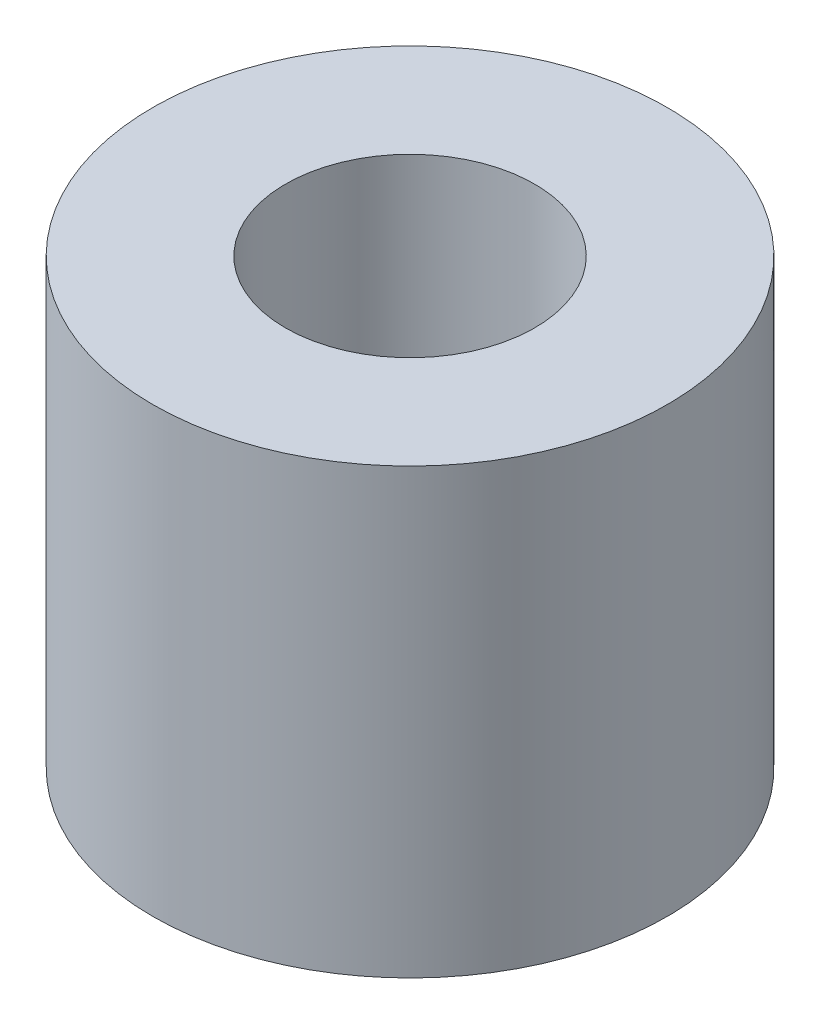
ISO-10303-21;
HEADER;
FILE_DESCRIPTION(('STEP AP214'),'2;1');
FILE_NAME('part.step','',(''),(''),'','','');
FILE_SCHEMA(('AUTOMOTIVE_DESIGN { 1 0 10303 214 1 1 1 1 }'));
ENDSEC;
DATA;
#1=APPLICATION_CONTEXT('core data for automotive mechanical design processes');
#2=APPLICATION_PROTOCOL_DEFINITION('international standard','automotive_design',2000,#1);
#3=PRODUCT_CONTEXT('',#1,'mechanical');
#4=PRODUCT('Part','Part','',(#3));
#5=PRODUCT_RELATED_PRODUCT_CATEGORY('part','',(#4));
#6=PRODUCT_DEFINITION_FORMATION('','',#4);
#7=PRODUCT_DEFINITION_CONTEXT('part definition',#1,'design');
#8=PRODUCT_DEFINITION('design','',#6,#7);
#9=PRODUCT_DEFINITION_SHAPE('','',#8);
#10=(LENGTH_UNIT() NAMED_UNIT(*) SI_UNIT(.MILLI.,.METRE.));
#11=(NAMED_UNIT(*) PLANE_ANGLE_UNIT() SI_UNIT($,.RADIAN.));
#12=(NAMED_UNIT(*) SI_UNIT($,.STERADIAN.) SOLID_ANGLE_UNIT());
#13=UNCERTAINTY_MEASURE_WITH_UNIT(LENGTH_MEASURE(1.E-05),#10,'distance_accuracy_value','');
#14=(GEOMETRIC_REPRESENTATION_CONTEXT(3) GLOBAL_UNCERTAINTY_ASSIGNED_CONTEXT((#13)) GLOBAL_UNIT_ASSIGNED_CONTEXT((#10,
#11,#12)) REPRESENTATION_CONTEXT('',''));
#15=CARTESIAN_POINT('',(0.,0.,0.));
#16=DIRECTION('',(0.,0.,1.));
#17=DIRECTION('',(1.,0.,0.));
#18=AXIS2_PLACEMENT_3D('',#15,#16,#17);
#19=CARTESIAN_POINT('',(0.,3.91351897,0.));
#20=DIRECTION('',(0.,1.,0.));
#21=DIRECTION('',(0.,0.,1.));
#22=AXIS2_PLACEMENT_3D('',#19,#20,#21);
#23=PLANE('',#22);
#24=CARTESIAN_POINT('',(0.,3.91351897,0.));
#25=DIRECTION('',(0.,1.,0.));
#26=DIRECTION('',(0.,0.,1.));
#27=AXIS2_PLACEMENT_3D('',#24,#25,#26);
#28=CIRCLE('',#27,2.27122893);
#29=CARTESIAN_POINT('',(0.,3.91351897,2.27122893));
#30=VERTEX_POINT('',#29);
#31=EDGE_CURVE('E10',#30,#30,#28,.T.);
#32=ORIENTED_EDGE('',*,*,#31,.T.);
#33=EDGE_LOOP('',(#32));
#34=FACE_BOUND('',#33,.T.);
#35=CARTESIAN_POINT('',(0.,3.91351897,0.));
#36=DIRECTION('',(0.,1.,0.));
#37=DIRECTION('',(0.,0.,1.));
#38=AXIS2_PLACEMENT_3D('',#35,#36,#37);
#39=CIRCLE('',#38,1.10000034);
#40=CARTESIAN_POINT('',(0.,3.91351897,1.10000034));
#41=VERTEX_POINT('',#40);
#42=EDGE_CURVE('E48',#41,#41,#39,.T.);
#43=ORIENTED_EDGE('',*,*,#42,.F.);
#44=EDGE_LOOP('',(#43));
#45=FACE_BOUND('',#44,.T.);
#46=ADVANCED_FACE('F37',(#34,#45),#23,.T.);
#47=CARTESIAN_POINT('',(0.,0.,0.));
#48=DIRECTION('',(0.,1.,0.));
#49=DIRECTION('',(0.,0.,1.));
#50=AXIS2_PLACEMENT_3D('',#47,#48,#49);
#51=PLANE('',#50);
#52=CARTESIAN_POINT('',(0.,0.,0.));
#53=DIRECTION('',(0.,1.,0.));
#54=DIRECTION('',(0.,0.,1.));
#55=AXIS2_PLACEMENT_3D('',#52,#53,#54);
#56=CIRCLE('',#55,2.27122893);
#57=CARTESIAN_POINT('',(0.,0.,2.27122893));
#58=VERTEX_POINT('',#57);
#59=EDGE_CURVE('E41',#58,#58,#56,.T.);
#60=ORIENTED_EDGE('',*,*,#59,.F.);
#61=EDGE_LOOP('',(#60));
#62=FACE_BOUND('',#61,.T.);
#63=CARTESIAN_POINT('',(0.,0.,0.));
#64=DIRECTION('',(0.,1.,0.));
#65=DIRECTION('',(0.,0.,1.));
#66=AXIS2_PLACEMENT_3D('',#63,#64,#65);
#67=CIRCLE('',#66,1.10000034);
#68=CARTESIAN_POINT('',(0.,0.,1.10000034));
#69=VERTEX_POINT('',#68);
#70=EDGE_CURVE('E50',#69,#69,#67,.T.);
#71=ORIENTED_EDGE('',*,*,#70,.T.);
#72=EDGE_LOOP('',(#71));
#73=FACE_BOUND('',#72,.T.);
#74=ADVANCED_FACE('F60',(#62,#73),#51,.F.);
#75=CARTESIAN_POINT('',(0.,3.91351897,0.));
#76=DIRECTION('',(0.,-1.,0.));
#77=DIRECTION('',(0.,0.,-1.));
#78=AXIS2_PLACEMENT_3D('',#75,#76,#77);
#79=CYLINDRICAL_SURFACE('',#78,2.27122893);
#80=ORIENTED_EDGE('',*,*,#31,.F.);
#81=EDGE_LOOP('',(#80));
#82=FACE_BOUND('',#81,.T.);
#83=ORIENTED_EDGE('',*,*,#59,.T.);
#84=EDGE_LOOP('',(#83));
#85=FACE_BOUND('',#84,.T.);
#86=ADVANCED_FACE('F39',(#82,#85),#79,.T.);
#87=CARTESIAN_POINT('',(0.,3.91351897,0.));
#88=DIRECTION('',(0.,-1.,0.));
#89=DIRECTION('',(0.,0.,-1.));
#90=AXIS2_PLACEMENT_3D('',#87,#88,#89);
#91=CYLINDRICAL_SURFACE('',#90,1.10000034);
#92=ORIENTED_EDGE('',*,*,#42,.T.);
#93=EDGE_LOOP('',(#92));
#94=FACE_BOUND('',#93,.T.);
#95=ORIENTED_EDGE('',*,*,#70,.F.);
#96=EDGE_LOOP('',(#95));
#97=FACE_BOUND('',#96,.T.);
#98=ADVANCED_FACE('F56',(#94,#97),#91,.F.);
#99=CLOSED_SHELL('',(#46,#74,#86,#98));
#100=MANIFOLD_SOLID_BREP('B2',#99);
#101=ADVANCED_BREP_SHAPE_REPRESENTATION('',(#18,#100),#14);
#102=SHAPE_DEFINITION_REPRESENTATION(#9,#101);
ENDSEC;
END-ISO-10303-21;
